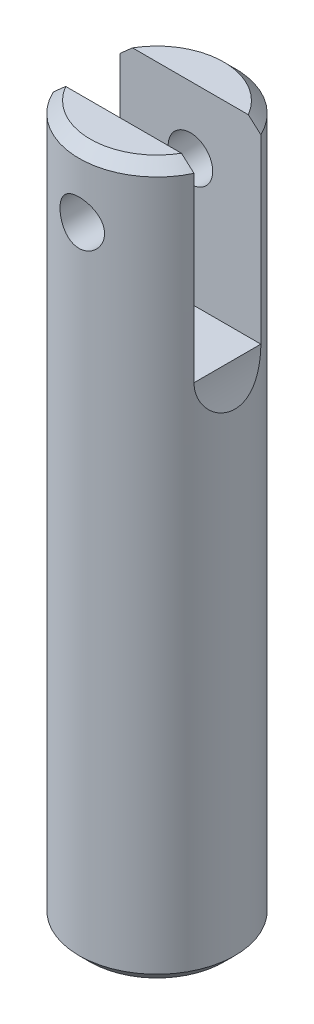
from build123d import *

# Parameters (mm, degrees)
SKETCH1_R               = 5.55625
BOSS_EXTRUDE1_DEPTH     = 50.8
CHAMFER1_SIZE           = 0.79375
SKETCH2_W               = 19.901734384
SKETCH2_H               = 4.7625
CUT_EXTRUDE1_DEPTH      = 13.716
CUT_EXTRUDE2_DEPTH      = 52.404122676
CUT_EXTRUDE2_DEPTH_BACK = 52.404122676
CUT_EXTRUDE3_DEPTH      = 52.404122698
CUT_EXTRUDE3_DEPTH_BACK = 52.404122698
SKETCH4_R               = 1.5875


with BuildPart() as part:
    # Sketch1 → Boss-Extrude1 (new body)
    with BuildSketch(Plane(origin=(0, 0, 0), x_dir=(1, 0, 0), z_dir=(0, 1, 0))):
        with Locations(Location((0, 0, 0), (0, 0, 270))):
            Circle(SKETCH1_R)
    extrude(amount=BOSS_EXTRUDE1_DEPTH)

    # Chamfer1
    chamfer1_edges = [part.edges().sort_by_distance(p)[0] for p in [
        (0, 0, -5.55625),
        (0, 50.8, -5.55625),
    ]]
    chamfer(chamfer1_edges, length=CHAMFER1_SIZE)

    # Sketch2 → Cut-Extrude1 (cut)
    with BuildSketch(Plane(origin=(0, 50.8, 0), x_dir=(1, 0, 0), z_dir=(0, 1, 0))):
        Rectangle(SKETCH2_W, SKETCH2_H)
    extrude(amount=-CUT_EXTRUDE1_DEPTH, mode=Mode.SUBTRACT)

    # Sketch3 → Cut-Extrude2 (cut, two sides: drawn at the far end of the back side and taken through both)
    with BuildSketch(Plane.XY.offset(-CUT_EXTRUDE2_DEPTH_BACK)):
        with BuildLine():
            Line((91.837981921, 32.770603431), (11.530940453, 30.736036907))
            ThreePointArc((11.530940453, 30.736036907), (6.937212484, 32.537367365), (5.020115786, 37.084))
            Line((5.020115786, 37.084), (5.020115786, 56.608855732))
            Line((5.020115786, 56.608855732), (-5.020115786, 56.608855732))
            Line((-5.020115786, 56.608855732), (-5.020115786, 37.084))
            ThreePointArc((-5.020115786, 37.084), (-6.709548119, 32.771041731), (-10.878890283, 30.753028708))
            Line((-10.878890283, 30.753028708), (-90.970971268, 24.538615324))
            Line((-90.970971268, 24.538615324), (-98.198508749, 185.041587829))
            Line((-98.198508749, 185.041587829), (84.61044444, 193.273575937))
            Line((84.61044444, 193.273575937), (91.837981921, 32.770603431))
        make_face()
    extrude(amount=CUT_EXTRUDE2_DEPTH + CUT_EXTRUDE2_DEPTH_BACK, mode=Mode.SUBTRACT)

    # Sketch4 → Cut-Extrude3 (cut, two sides: drawn at the far end of the back side and taken through both)
    with BuildSketch(Plane.XY.offset(-CUT_EXTRUDE3_DEPTH_BACK)):
        with Locations(Location((0, 46.0375, 0), (0, 0, 90))):
            Circle(SKETCH4_R)
    extrude(amount=CUT_EXTRUDE3_DEPTH + CUT_EXTRUDE3_DEPTH_BACK, mode=Mode.SUBTRACT)


solid = part.part
